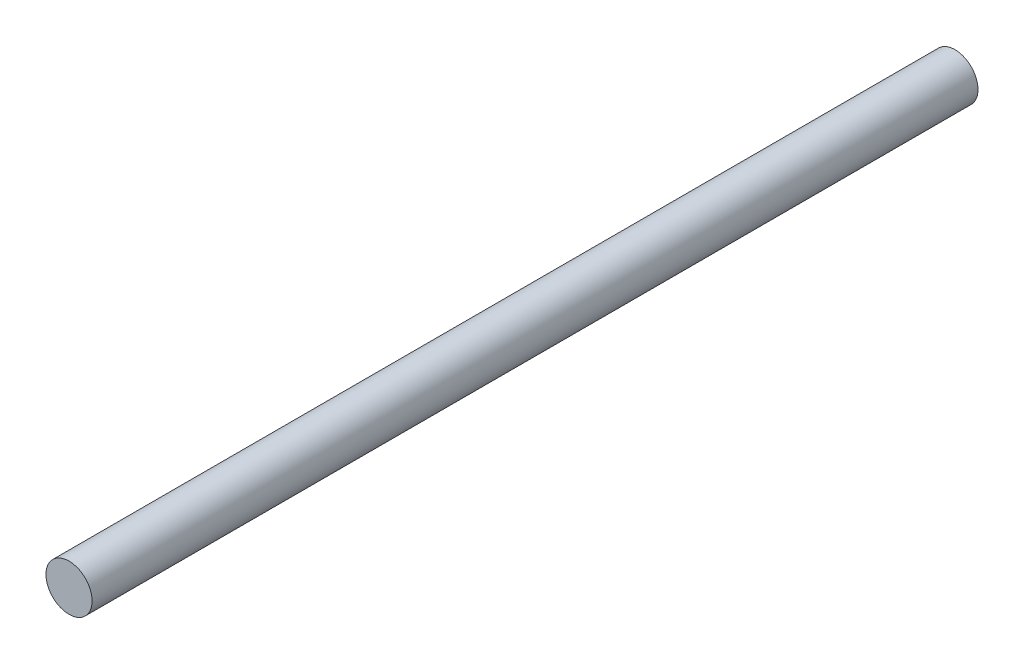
from build123d import *

# Parameters (mm, degrees)
ESQUISSE1_R      = 2.5
EXTRUSION1_DEPTH = 96


with BuildPart() as part:
    # Esquisse1 → Extrusion1 (new body)
    with BuildSketch(Plane.XY):
        Circle(ESQUISSE1_R)
    extrude(amount=EXTRUSION1_DEPTH)


solid = part.part
